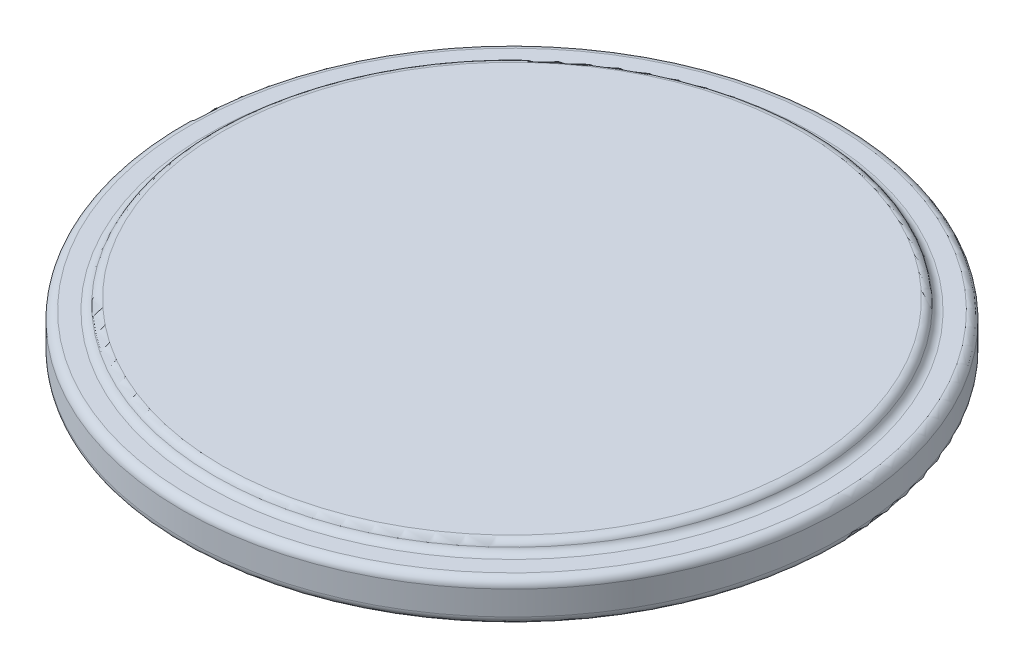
ISO-10303-21;
HEADER;
FILE_DESCRIPTION(('STEP AP214'),'2;1');
FILE_NAME('part.step','',(''),(''),'','','');
FILE_SCHEMA(('AUTOMOTIVE_DESIGN { 1 0 10303 214 1 1 1 1 }'));
ENDSEC;
DATA;
#1=APPLICATION_CONTEXT('core data for automotive mechanical design processes');
#2=APPLICATION_PROTOCOL_DEFINITION('international standard','automotive_design',2000,#1);
#3=PRODUCT_CONTEXT('',#1,'mechanical');
#4=PRODUCT('Part','Part','',(#3));
#5=PRODUCT_RELATED_PRODUCT_CATEGORY('part','',(#4));
#6=PRODUCT_DEFINITION_FORMATION('','',#4);
#7=PRODUCT_DEFINITION_CONTEXT('part definition',#1,'design');
#8=PRODUCT_DEFINITION('design','',#6,#7);
#9=PRODUCT_DEFINITION_SHAPE('','',#8);
#10=(LENGTH_UNIT() NAMED_UNIT(*) SI_UNIT(.MILLI.,.METRE.));
#11=(NAMED_UNIT(*) PLANE_ANGLE_UNIT() SI_UNIT($,.RADIAN.));
#12=(NAMED_UNIT(*) SI_UNIT($,.STERADIAN.) SOLID_ANGLE_UNIT());
#13=UNCERTAINTY_MEASURE_WITH_UNIT(LENGTH_MEASURE(1.E-05),#10,'distance_accuracy_value','');
#14=(GEOMETRIC_REPRESENTATION_CONTEXT(3) GLOBAL_UNCERTAINTY_ASSIGNED_CONTEXT((#13)) GLOBAL_UNIT_ASSIGNED_CONTEXT((#10,
#11,#12)) REPRESENTATION_CONTEXT('',''));
#15=CARTESIAN_POINT('',(0.,0.,0.));
#16=DIRECTION('',(0.,0.,1.));
#17=DIRECTION('',(1.,0.,0.));
#18=AXIS2_PLACEMENT_3D('',#15,#16,#17);
#19=CARTESIAN_POINT('',(0.,0.,0.));
#20=DIRECTION('',(0.,-1.,0.));
#21=DIRECTION('',(0.,0.,-1.));
#22=AXIS2_PLACEMENT_3D('',#19,#20,#21);
#23=PLANE('',#22);
#24=CARTESIAN_POINT('',(0.,0.,0.));
#25=DIRECTION('',(0.,-1.,0.));
#26=DIRECTION('',(0.,0.,-1.));
#27=AXIS2_PLACEMENT_3D('',#24,#25,#26);
#28=CIRCLE('',#27,8.75388181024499);
#29=CARTESIAN_POINT('',(0.,0.,-8.75388181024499));
#30=VERTEX_POINT('',#29);
#31=EDGE_CURVE('E80',#30,#30,#28,.T.);
#32=ORIENTED_EDGE('',*,*,#31,.T.);
#33=EDGE_LOOP('',(#32));
#34=FACE_BOUND('',#33,.T.);
#35=ADVANCED_FACE('F52',(#34),#23,.T.);
#36=CARTESIAN_POINT('',(0.,0.,0.));
#37=DIRECTION('',(0.,1.,0.));
#38=DIRECTION('',(0.,0.,1.));
#39=AXIS2_PLACEMENT_3D('',#36,#37,#38);
#40=CONICAL_SURFACE('',#39,8.89,1.0471975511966);
#41=CARTESIAN_POINT('',(0.,6.45246660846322,0.));
#42=DIRECTION('',(0.,-1.,0.));
#43=DIRECTION('',(0.,0.,-1.));
#44=AXIS2_PLACEMENT_3D('',#41,#42,#43);
#45=CIRCLE('',#44,20.066);
#46=CARTESIAN_POINT('',(0.,6.45246660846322,-20.066));
#47=VERTEX_POINT('',#46);
#48=EDGE_CURVE('E84',#47,#47,#45,.T.);
#49=ORIENTED_EDGE('',*,*,#48,.T.);
#50=EDGE_LOOP('',(#49));
#51=FACE_BOUND('',#50,.T.);
#52=CARTESIAN_POINT('',(0.,0.0680590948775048,0.));
#53=DIRECTION('',(0.,-1.,0.));
#54=DIRECTION('',(0.,0.,-1.));
#55=AXIS2_PLACEMENT_3D('',#52,#53,#54);
#56=CIRCLE('',#55,9.00788181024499);
#57=CARTESIAN_POINT('',(0.,0.0680590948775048,-9.00788181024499));
#58=VERTEX_POINT('',#57);
#59=EDGE_CURVE('E88',#58,#58,#56,.F.);
#60=ORIENTED_EDGE('',*,*,#59,.T.);
#61=EDGE_LOOP('',(#60));
#62=FACE_BOUND('',#61,.T.);
#63=ADVANCED_FACE('F106',(#51,#62),#40,.T.);
#64=CARTESIAN_POINT('',(0.,0.,0.));
#65=DIRECTION('',(0.,-1.,0.));
#66=DIRECTION('',(0.,0.,-1.));
#67=AXIS2_PLACEMENT_3D('',#64,#65,#66);
#68=CYLINDRICAL_SURFACE('',#67,20.32);
#69=CARTESIAN_POINT('',(0.,8.382,0.));
#70=DIRECTION('',(0.,-1.,0.));
#71=DIRECTION('',(0.,0.,-1.));
#72=AXIS2_PLACEMENT_3D('',#69,#70,#71);
#73=CIRCLE('',#72,20.32);
#74=CARTESIAN_POINT('',(0.,8.382,-20.32));
#75=VERTEX_POINT('',#74);
#76=EDGE_CURVE('E66',#75,#75,#73,.T.);
#77=ORIENTED_EDGE('',*,*,#76,.T.);
#78=EDGE_LOOP('',(#77));
#79=FACE_BOUND('',#78,.T.);
#80=CARTESIAN_POINT('',(0.,6.89240751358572,0.));
#81=DIRECTION('',(0.,1.,0.));
#82=DIRECTION('',(0.,0.,1.));
#83=AXIS2_PLACEMENT_3D('',#80,#81,#82);
#84=CIRCLE('',#83,20.32);
#85=CARTESIAN_POINT('',(0.,6.89240751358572,20.32));
#86=VERTEX_POINT('',#85);
#87=EDGE_CURVE('E92',#86,#86,#84,.T.);
#88=ORIENTED_EDGE('',*,*,#87,.T.);
#89=EDGE_LOOP('',(#88));
#90=FACE_BOUND('',#89,.T.);
#91=ADVANCED_FACE('F97',(#79,#90),#68,.T.);
#92=CARTESIAN_POINT('',(0.,6.89240751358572,0.));
#93=DIRECTION('',(0.,1.,0.));
#94=DIRECTION('',(0.,0.,1.));
#95=AXIS2_PLACEMENT_3D('',#92,#93,#94);
#96=TOROIDAL_SURFACE('',#95,19.812,0.508);
#97=ORIENTED_EDGE('',*,*,#87,.F.);
#98=EDGE_LOOP('',(#97));
#99=FACE_BOUND('',#98,.T.);
#100=ORIENTED_EDGE('',*,*,#48,.F.);
#101=EDGE_LOOP('',(#100));
#102=FACE_BOUND('',#101,.T.);
#103=ADVANCED_FACE('F99',(#99,#102),#96,.T.);
#104=CARTESIAN_POINT('',(0.,0.508,0.));
#105=DIRECTION('',(0.,-1.,0.));
#106=DIRECTION('',(0.,0.,-1.));
#107=AXIS2_PLACEMENT_3D('',#104,#105,#106);
#108=TOROIDAL_SURFACE('',#107,8.75388181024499,0.508);
#109=ORIENTED_EDGE('',*,*,#59,.F.);
#110=EDGE_LOOP('',(#109));
#111=FACE_BOUND('',#110,.T.);
#112=ORIENTED_EDGE('',*,*,#31,.F.);
#113=EDGE_LOOP('',(#112));
#114=FACE_BOUND('',#113,.T.);
#115=ADVANCED_FACE('F102',(#111,#114),#108,.T.);
#116=CARTESIAN_POINT('',(0.,8.89,0.));
#117=DIRECTION('',(0.,-1.,0.));
#118=DIRECTION('',(0.,0.,-1.));
#119=AXIS2_PLACEMENT_3D('',#116,#117,#118);
#120=PLANE('',#119);
#121=CARTESIAN_POINT('',(0.,8.89,0.));
#122=DIRECTION('',(0.,-1.,0.));
#123=DIRECTION('',(0.,0.,-1.));
#124=AXIS2_PLACEMENT_3D('',#121,#122,#123);
#125=CIRCLE('',#124,19.812);
#126=CARTESIAN_POINT('',(0.,8.89,-19.812));
#127=VERTEX_POINT('',#126);
#128=EDGE_CURVE('E71',#127,#127,#125,.F.);
#129=ORIENTED_EDGE('',*,*,#128,.T.);
#130=EDGE_LOOP('',(#129));
#131=FACE_BOUND('',#130,.T.);
#132=CARTESIAN_POINT('',(0.,8.89,0.));
#133=DIRECTION('',(0.,-1.,0.));
#134=DIRECTION('',(0.,0.,-1.));
#135=AXIS2_PLACEMENT_3D('',#132,#133,#134);
#136=CIRCLE('',#135,18.796);
#137=CARTESIAN_POINT('',(0.,8.89,-18.796));
#138=VERTEX_POINT('',#137);
#139=EDGE_CURVE('E77',#138,#138,#136,.T.);
#140=ORIENTED_EDGE('',*,*,#139,.T.);
#141=EDGE_LOOP('',(#140));
#142=FACE_BOUND('',#141,.T.);
#143=ADVANCED_FACE('F114',(#131,#142),#120,.F.);
#144=CARTESIAN_POINT('',(0.,9.525,-20.32));
#145=DIRECTION('',(0.,1.,0.));
#146=DIRECTION('',(0.,0.,1.));
#147=AXIS2_PLACEMENT_3D('',#144,#145,#146);
#148=PLANE('',#147);
#149=CARTESIAN_POINT('',(0.,9.525,0.));
#150=DIRECTION('',(0.,1.,0.));
#151=DIRECTION('',(0.,0.,1.));
#152=AXIS2_PLACEMENT_3D('',#149,#150,#151);
#153=CIRCLE('',#152,17.8541427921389);
#154=CARTESIAN_POINT('',(0.,9.525,17.8541427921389));
#155=VERTEX_POINT('',#154);
#156=EDGE_CURVE('E60',#155,#155,#153,.T.);
#157=ORIENTED_EDGE('',*,*,#156,.T.);
#158=EDGE_LOOP('',(#157));
#159=FACE_BOUND('',#158,.T.);
#160=ADVANCED_FACE('F127',(#159),#148,.T.);
#161=CARTESIAN_POINT('',(0.,8.382,0.));
#162=DIRECTION('',(0.,-1.,0.));
#163=DIRECTION('',(0.,0.,-1.));
#164=AXIS2_PLACEMENT_3D('',#161,#162,#163);
#165=TOROIDAL_SURFACE('',#164,19.812,0.508);
#166=ORIENTED_EDGE('',*,*,#76,.F.);
#167=EDGE_LOOP('',(#166));
#168=FACE_BOUND('',#167,.T.);
#169=ORIENTED_EDGE('',*,*,#128,.F.);
#170=EDGE_LOOP('',(#169));
#171=FACE_BOUND('',#170,.T.);
#172=ADVANCED_FACE('F124',(#168,#171),#165,.T.);
#173=CARTESIAN_POINT('',(0.,9.398,0.));
#174=DIRECTION('',(0.,-1.,0.));
#175=DIRECTION('',(0.,0.,-1.));
#176=AXIS2_PLACEMENT_3D('',#173,#174,#175);
#177=TOROIDAL_SURFACE('',#176,18.796,0.508);
#178=CARTESIAN_POINT('',(0.,9.20749999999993,0.));
#179=DIRECTION('',(0.,1.,0.));
#180=DIRECTION('',(0.,0.,1.));
#181=AXIS2_PLACEMENT_3D('',#178,#179,#180);
#182=CIRCLE('',#181,18.3250713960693);
#183=CARTESIAN_POINT('',(0.,9.20749999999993,18.3250713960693));
#184=VERTEX_POINT('',#183);
#185=EDGE_CURVE('E12',#184,#184,#182,.F.);
#186=ORIENTED_EDGE('',*,*,#185,.T.);
#187=EDGE_LOOP('',(#186));
#188=FACE_BOUND('',#187,.T.);
#189=ORIENTED_EDGE('',*,*,#139,.F.);
#190=EDGE_LOOP('',(#189));
#191=FACE_BOUND('',#190,.T.);
#192=ADVANCED_FACE('F126',(#188,#191),#177,.F.);
#193=CARTESIAN_POINT('',(0.,9.017,0.));
#194=DIRECTION('',(0.,-1.,0.));
#195=DIRECTION('',(0.,0.,-1.));
#196=AXIS2_PLACEMENT_3D('',#193,#194,#195);
#197=TOROIDAL_SURFACE('',#196,17.8541427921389,0.508);
#198=ORIENTED_EDGE('',*,*,#185,.F.);
#199=EDGE_LOOP('',(#198));
#200=FACE_BOUND('',#199,.T.);
#201=ORIENTED_EDGE('',*,*,#156,.F.);
#202=EDGE_LOOP('',(#201));
#203=FACE_BOUND('',#202,.T.);
#204=ADVANCED_FACE('F54',(#200,#203),#197,.T.);
#205=CLOSED_SHELL('',(#35,#63,#91,#103,#115,#143,#160,#172,#192,#204));
#206=MANIFOLD_SOLID_BREP('B2',#205);
#207=ADVANCED_BREP_SHAPE_REPRESENTATION('',(#18,#206),#14);
#208=SHAPE_DEFINITION_REPRESENTATION(#9,#207);
ENDSEC;
END-ISO-10303-21;
